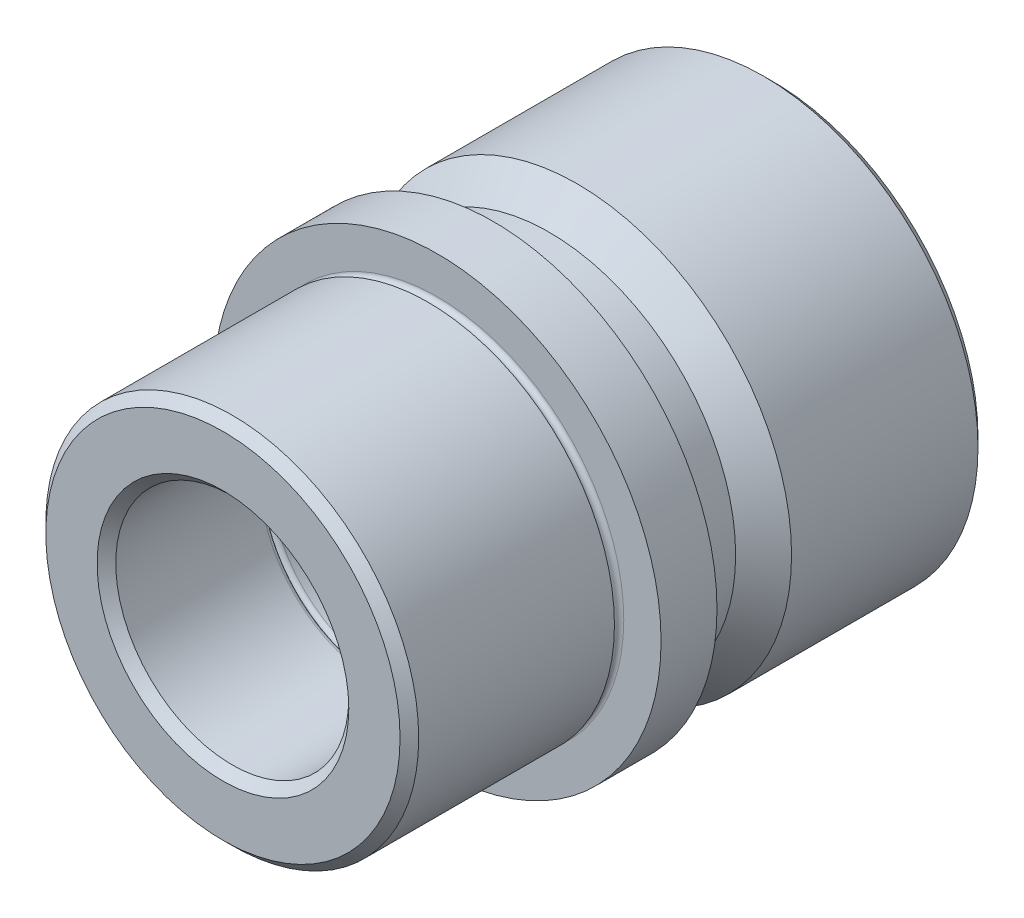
ISO-10303-21;
HEADER;
FILE_DESCRIPTION(('STEP AP214'),'2;1');
FILE_NAME('part.step','',(''),(''),'','','');
FILE_SCHEMA(('AUTOMOTIVE_DESIGN { 1 0 10303 214 1 1 1 1 }'));
ENDSEC;
DATA;
#1=APPLICATION_CONTEXT('core data for automotive mechanical design processes');
#2=APPLICATION_PROTOCOL_DEFINITION('international standard','automotive_design',2000,#1);
#3=PRODUCT_CONTEXT('',#1,'mechanical');
#4=PRODUCT('Part','Part','',(#3));
#5=PRODUCT_RELATED_PRODUCT_CATEGORY('part','',(#4));
#6=PRODUCT_DEFINITION_FORMATION('','',#4);
#7=PRODUCT_DEFINITION_CONTEXT('part definition',#1,'design');
#8=PRODUCT_DEFINITION('design','',#6,#7);
#9=PRODUCT_DEFINITION_SHAPE('','',#8);
#10=(LENGTH_UNIT() NAMED_UNIT(*) SI_UNIT(.MILLI.,.METRE.));
#11=(NAMED_UNIT(*) PLANE_ANGLE_UNIT() SI_UNIT($,.RADIAN.));
#12=(NAMED_UNIT(*) SI_UNIT($,.STERADIAN.) SOLID_ANGLE_UNIT());
#13=UNCERTAINTY_MEASURE_WITH_UNIT(LENGTH_MEASURE(1.E-05),#10,'distance_accuracy_value','');
#14=(GEOMETRIC_REPRESENTATION_CONTEXT(3) GLOBAL_UNCERTAINTY_ASSIGNED_CONTEXT((#13)) GLOBAL_UNIT_ASSIGNED_CONTEXT((#10,
#11,#12)) REPRESENTATION_CONTEXT('',''));
#15=CARTESIAN_POINT('',(0.,0.,0.));
#16=DIRECTION('',(0.,0.,1.));
#17=DIRECTION('',(1.,0.,0.));
#18=AXIS2_PLACEMENT_3D('',#15,#16,#17);
#19=CARTESIAN_POINT('',(0.,0.,-37.5));
#20=DIRECTION('',(0.,0.,1.));
#21=DIRECTION('',(1.,0.,0.));
#22=AXIS2_PLACEMENT_3D('',#19,#20,#21);
#23=TOROIDAL_SURFACE('',#22,13.,0.5);
#24=CARTESIAN_POINT('',(0.,0.,-37.5));
#25=DIRECTION('',(0.,0.,1.));
#26=DIRECTION('',(1.,0.,0.));
#27=AXIS2_PLACEMENT_3D('',#24,#25,#26);
#28=CIRCLE('',#27,12.5);
#29=CARTESIAN_POINT('',(12.5,0.,-37.5));
#30=VERTEX_POINT('',#29);
#31=EDGE_CURVE('E81',#30,#30,#28,.T.);
#32=ORIENTED_EDGE('',*,*,#31,.T.);
#33=EDGE_LOOP('',(#32));
#34=FACE_BOUND('',#33,.T.);
#35=CARTESIAN_POINT('',(0.,0.,-38.));
#36=DIRECTION('',(0.,0.,1.));
#37=DIRECTION('',(1.,0.,0.));
#38=AXIS2_PLACEMENT_3D('',#35,#36,#37);
#39=CIRCLE('',#38,13.);
#40=CARTESIAN_POINT('',(13.,0.,-38.));
#41=VERTEX_POINT('',#40);
#42=EDGE_CURVE('E45',#41,#41,#39,.T.);
#43=ORIENTED_EDGE('',*,*,#42,.F.);
#44=EDGE_LOOP('',(#43));
#45=FACE_BOUND('',#44,.T.);
#46=ADVANCED_FACE('F13',(#34,#45),#23,.T.);
#47=CARTESIAN_POINT('',(0.,0.,-38.5));
#48=DIRECTION('',(0.,0.,1.));
#49=DIRECTION('',(1.,0.,0.));
#50=AXIS2_PLACEMENT_3D('',#47,#48,#49);
#51=TOROIDAL_SURFACE('',#50,13.,0.5);
#52=CARTESIAN_POINT('',(0.,0.,-38.5));
#53=DIRECTION('',(0.,0.,1.));
#54=DIRECTION('',(1.,0.,0.));
#55=AXIS2_PLACEMENT_3D('',#52,#53,#54);
#56=CIRCLE('',#55,12.5);
#57=CARTESIAN_POINT('',(12.5,0.,-38.5));
#58=VERTEX_POINT('',#57);
#59=EDGE_CURVE('E48',#58,#58,#56,.T.);
#60=ORIENTED_EDGE('',*,*,#59,.F.);
#61=EDGE_LOOP('',(#60));
#62=FACE_BOUND('',#61,.T.);
#63=ORIENTED_EDGE('',*,*,#42,.T.);
#64=EDGE_LOOP('',(#63));
#65=FACE_BOUND('',#64,.T.);
#66=ADVANCED_FACE('F114',(#62,#65),#51,.T.);
#67=CARTESIAN_POINT('',(0.,0.,0.));
#68=DIRECTION('',(0.,0.,1.));
#69=DIRECTION('',(1.,0.,0.));
#70=AXIS2_PLACEMENT_3D('',#67,#68,#69);
#71=CYLINDRICAL_SURFACE('',#70,12.5);
#72=CARTESIAN_POINT('',(0.,0.,-58.));
#73=DIRECTION('',(0.,0.,1.));
#74=DIRECTION('',(1.,0.,0.));
#75=AXIS2_PLACEMENT_3D('',#72,#73,#74);
#76=CIRCLE('',#75,12.5);
#77=CARTESIAN_POINT('',(12.5,0.,-58.));
#78=VERTEX_POINT('',#77);
#79=EDGE_CURVE('E36',#78,#78,#76,.F.);
#80=ORIENTED_EDGE('',*,*,#79,.T.);
#81=EDGE_LOOP('',(#80));
#82=FACE_BOUND('',#81,.T.);
#83=ORIENTED_EDGE('',*,*,#59,.T.);
#84=EDGE_LOOP('',(#83));
#85=FACE_BOUND('',#84,.T.);
#86=ADVANCED_FACE('F120',(#82,#85),#71,.F.);
#87=CARTESIAN_POINT('',(0.,0.,-59.));
#88=DIRECTION('',(0.,0.,1.));
#89=DIRECTION('',(1.,0.,0.));
#90=AXIS2_PLACEMENT_3D('',#87,#88,#89);
#91=PLANE('',#90);
#92=CARTESIAN_POINT('',(0.,0.,-59.));
#93=DIRECTION('',(0.,0.,1.));
#94=DIRECTION('',(1.,0.,0.));
#95=AXIS2_PLACEMENT_3D('',#92,#93,#94);
#96=CIRCLE('',#95,13.5);
#97=CARTESIAN_POINT('',(13.5,0.,-59.));
#98=VERTEX_POINT('',#97);
#99=EDGE_CURVE('E39',#98,#98,#96,.T.);
#100=ORIENTED_EDGE('',*,*,#99,.T.);
#101=EDGE_LOOP('',(#100));
#102=FACE_BOUND('',#101,.T.);
#103=CARTESIAN_POINT('',(0.,0.,-59.));
#104=DIRECTION('',(0.,0.,1.));
#105=DIRECTION('',(1.,0.,0.));
#106=AXIS2_PLACEMENT_3D('',#103,#104,#105);
#107=CIRCLE('',#106,22.);
#108=CARTESIAN_POINT('',(22.,0.,-59.));
#109=VERTEX_POINT('',#108);
#110=EDGE_CURVE('E42',#109,#109,#107,.F.);
#111=ORIENTED_EDGE('',*,*,#110,.T.);
#112=EDGE_LOOP('',(#111));
#113=FACE_BOUND('',#112,.T.);
#114=ADVANCED_FACE('F185',(#102,#113),#91,.F.);
#115=CARTESIAN_POINT('',(0.,0.,0.));
#116=DIRECTION('',(0.,0.,1.));
#117=DIRECTION('',(1.,0.,0.));
#118=AXIS2_PLACEMENT_3D('',#115,#116,#117);
#119=CYLINDRICAL_SURFACE('',#118,23.);
#120=CARTESIAN_POINT('',(0.,0.,-58.));
#121=DIRECTION('',(0.,0.,1.));
#122=DIRECTION('',(1.,0.,0.));
#123=AXIS2_PLACEMENT_3D('',#120,#121,#122);
#124=CIRCLE('',#123,23.);
#125=CARTESIAN_POINT('',(23.,0.,-58.));
#126=VERTEX_POINT('',#125);
#127=EDGE_CURVE('E33',#126,#126,#124,.T.);
#128=ORIENTED_EDGE('',*,*,#127,.T.);
#129=EDGE_LOOP('',(#128));
#130=FACE_BOUND('',#129,.T.);
#131=CARTESIAN_POINT('',(0.,0.,-38.));
#132=DIRECTION('',(0.,0.,1.));
#133=DIRECTION('',(1.,0.,0.));
#134=AXIS2_PLACEMENT_3D('',#131,#132,#133);
#135=CIRCLE('',#134,23.);
#136=CARTESIAN_POINT('',(23.,0.,-38.));
#137=VERTEX_POINT('',#136);
#138=EDGE_CURVE('E51',#137,#137,#135,.T.);
#139=ORIENTED_EDGE('',*,*,#138,.F.);
#140=EDGE_LOOP('',(#139));
#141=FACE_BOUND('',#140,.T.);
#142=ADVANCED_FACE('F181',(#130,#141),#119,.T.);
#143=CARTESIAN_POINT('',(0.,0.,-35.));
#144=DIRECTION('',(0.,0.,-1.));
#145=DIRECTION('',(-1.,0.,0.));
#146=AXIS2_PLACEMENT_3D('',#143,#144,#145);
#147=CONICAL_SURFACE('',#146,20.,0.785398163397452);
#148=ORIENTED_EDGE('',*,*,#138,.T.);
#149=EDGE_LOOP('',(#148));
#150=FACE_BOUND('',#149,.T.);
#151=CARTESIAN_POINT('',(0.,0.,-35.));
#152=DIRECTION('',(0.,0.,1.));
#153=DIRECTION('',(1.,0.,0.));
#154=AXIS2_PLACEMENT_3D('',#151,#152,#153);
#155=CIRCLE('',#154,20.);
#156=CARTESIAN_POINT('',(20.,0.,-35.));
#157=VERTEX_POINT('',#156);
#158=EDGE_CURVE('E54',#157,#157,#155,.T.);
#159=ORIENTED_EDGE('',*,*,#158,.F.);
#160=EDGE_LOOP('',(#159));
#161=FACE_BOUND('',#160,.T.);
#162=ADVANCED_FACE('F177',(#150,#161),#147,.T.);
#163=CARTESIAN_POINT('',(0.,0.,0.));
#164=DIRECTION('',(0.,0.,1.));
#165=DIRECTION('',(1.,0.,0.));
#166=AXIS2_PLACEMENT_3D('',#163,#164,#165);
#167=CYLINDRICAL_SURFACE('',#166,20.);
#168=ORIENTED_EDGE('',*,*,#158,.T.);
#169=EDGE_LOOP('',(#168));
#170=FACE_BOUND('',#169,.T.);
#171=CARTESIAN_POINT('',(0.,0.,-29.));
#172=DIRECTION('',(0.,0.,1.));
#173=DIRECTION('',(1.,0.,0.));
#174=AXIS2_PLACEMENT_3D('',#171,#172,#173);
#175=CIRCLE('',#174,20.);
#176=CARTESIAN_POINT('',(20.,0.,-29.));
#177=VERTEX_POINT('',#176);
#178=EDGE_CURVE('E57',#177,#177,#175,.T.);
#179=ORIENTED_EDGE('',*,*,#178,.F.);
#180=EDGE_LOOP('',(#179));
#181=FACE_BOUND('',#180,.T.);
#182=ADVANCED_FACE('F173',(#170,#181),#167,.T.);
#183=CARTESIAN_POINT('',(0.,0.,-29.));
#184=DIRECTION('',(0.,0.,-1.));
#185=DIRECTION('',(-1.,0.,0.));
#186=AXIS2_PLACEMENT_3D('',#183,#184,#185);
#187=PLANE('',#186);
#188=ORIENTED_EDGE('',*,*,#178,.T.);
#189=EDGE_LOOP('',(#188));
#190=FACE_BOUND('',#189,.T.);
#191=CARTESIAN_POINT('',(0.,0.,-29.));
#192=DIRECTION('',(0.,0.,1.));
#193=DIRECTION('',(1.,0.,0.));
#194=AXIS2_PLACEMENT_3D('',#191,#192,#193);
#195=CIRCLE('',#194,24.);
#196=CARTESIAN_POINT('',(24.,0.,-29.));
#197=VERTEX_POINT('',#196);
#198=EDGE_CURVE('E60',#197,#197,#195,.T.);
#199=ORIENTED_EDGE('',*,*,#198,.F.);
#200=EDGE_LOOP('',(#199));
#201=FACE_BOUND('',#200,.T.);
#202=ADVANCED_FACE('F169',(#190,#201),#187,.T.);
#203=CARTESIAN_POINT('',(0.,0.,0.));
#204=DIRECTION('',(0.,0.,1.));
#205=DIRECTION('',(1.,0.,0.));
#206=AXIS2_PLACEMENT_3D('',#203,#204,#205);
#207=CYLINDRICAL_SURFACE('',#206,24.);
#208=ORIENTED_EDGE('',*,*,#198,.T.);
#209=EDGE_LOOP('',(#208));
#210=FACE_BOUND('',#209,.T.);
#211=CARTESIAN_POINT('',(0.,0.,-23.));
#212=DIRECTION('',(0.,0.,1.));
#213=DIRECTION('',(1.,0.,0.));
#214=AXIS2_PLACEMENT_3D('',#211,#212,#213);
#215=CIRCLE('',#214,24.);
#216=CARTESIAN_POINT('',(24.,0.,-23.));
#217=VERTEX_POINT('',#216);
#218=EDGE_CURVE('E63',#217,#217,#215,.T.);
#219=ORIENTED_EDGE('',*,*,#218,.F.);
#220=EDGE_LOOP('',(#219));
#221=FACE_BOUND('',#220,.T.);
#222=ADVANCED_FACE('F165',(#210,#221),#207,.T.);
#223=CARTESIAN_POINT('',(0.,0.,-23.));
#224=DIRECTION('',(0.,0.,1.));
#225=DIRECTION('',(1.,0.,0.));
#226=AXIS2_PLACEMENT_3D('',#223,#224,#225);
#227=PLANE('',#226);
#228=ORIENTED_EDGE('',*,*,#218,.T.);
#229=EDGE_LOOP('',(#228));
#230=FACE_BOUND('',#229,.T.);
#231=CARTESIAN_POINT('',(0.,0.,-23.));
#232=DIRECTION('',(0.,0.,1.));
#233=DIRECTION('',(1.,0.,0.));
#234=AXIS2_PLACEMENT_3D('',#231,#232,#233);
#235=CIRCLE('',#234,20.);
#236=CARTESIAN_POINT('',(20.,0.,-23.));
#237=VERTEX_POINT('',#236);
#238=EDGE_CURVE('E66',#237,#237,#235,.T.);
#239=ORIENTED_EDGE('',*,*,#238,.F.);
#240=EDGE_LOOP('',(#239));
#241=FACE_BOUND('',#240,.T.);
#242=ADVANCED_FACE('F161',(#230,#241),#227,.T.);
#243=CARTESIAN_POINT('',(0.,0.,-22.5));
#244=DIRECTION('',(0.,0.,1.));
#245=DIRECTION('',(1.,0.,0.));
#246=AXIS2_PLACEMENT_3D('',#243,#244,#245);
#247=TOROIDAL_SURFACE('',#246,20.,0.5);
#248=ORIENTED_EDGE('',*,*,#238,.T.);
#249=EDGE_LOOP('',(#248));
#250=FACE_BOUND('',#249,.T.);
#251=CARTESIAN_POINT('',(0.,0.,-22.));
#252=DIRECTION('',(0.,0.,1.));
#253=DIRECTION('',(1.,0.,0.));
#254=AXIS2_PLACEMENT_3D('',#251,#252,#253);
#255=CIRCLE('',#254,20.);
#256=CARTESIAN_POINT('',(20.,0.,-22.));
#257=VERTEX_POINT('',#256);
#258=EDGE_CURVE('E69',#257,#257,#255,.T.);
#259=ORIENTED_EDGE('',*,*,#258,.F.);
#260=EDGE_LOOP('',(#259));
#261=FACE_BOUND('',#260,.T.);
#262=ADVANCED_FACE('F156',(#250,#261),#247,.F.);
#263=CARTESIAN_POINT('',(0.,0.,0.));
#264=DIRECTION('',(0.,0.,1.));
#265=DIRECTION('',(1.,0.,0.));
#266=AXIS2_PLACEMENT_3D('',#263,#264,#265);
#267=CYLINDRICAL_SURFACE('',#266,20.);
#268=CARTESIAN_POINT('',(0.,0.,-1.));
#269=DIRECTION('',(0.,0.,1.));
#270=DIRECTION('',(1.,0.,0.));
#271=AXIS2_PLACEMENT_3D('',#268,#269,#270);
#272=CIRCLE('',#271,20.);
#273=CARTESIAN_POINT('',(20.,0.,-1.));
#274=VERTEX_POINT('',#273);
#275=EDGE_CURVE('E8',#274,#274,#272,.F.);
#276=ORIENTED_EDGE('',*,*,#275,.T.);
#277=EDGE_LOOP('',(#276));
#278=FACE_BOUND('',#277,.T.);
#279=ORIENTED_EDGE('',*,*,#258,.T.);
#280=EDGE_LOOP('',(#279));
#281=FACE_BOUND('',#280,.T.);
#282=ADVANCED_FACE('F150',(#278,#281),#267,.T.);
#283=CARTESIAN_POINT('',(0.,0.,0.));
#284=DIRECTION('',(0.,0.,1.));
#285=DIRECTION('',(1.,0.,0.));
#286=AXIS2_PLACEMENT_3D('',#283,#284,#285);
#287=PLANE('',#286);
#288=CARTESIAN_POINT('',(0.,0.,0.));
#289=DIRECTION('',(0.,0.,1.));
#290=DIRECTION('',(1.,0.,0.));
#291=AXIS2_PLACEMENT_3D('',#288,#289,#290);
#292=CIRCLE('',#291,13.5);
#293=CARTESIAN_POINT('',(13.5,0.,0.));
#294=VERTEX_POINT('',#293);
#295=EDGE_CURVE('E20',#294,#294,#292,.F.);
#296=ORIENTED_EDGE('',*,*,#295,.T.);
#297=EDGE_LOOP('',(#296));
#298=FACE_BOUND('',#297,.T.);
#299=CARTESIAN_POINT('',(0.,0.,0.));
#300=DIRECTION('',(0.,0.,1.));
#301=DIRECTION('',(1.,0.,0.));
#302=AXIS2_PLACEMENT_3D('',#299,#300,#301);
#303=CIRCLE('',#302,19.);
#304=CARTESIAN_POINT('',(19.,0.,0.));
#305=VERTEX_POINT('',#304);
#306=EDGE_CURVE('E24',#305,#305,#303,.T.);
#307=ORIENTED_EDGE('',*,*,#306,.T.);
#308=EDGE_LOOP('',(#307));
#309=FACE_BOUND('',#308,.T.);
#310=ADVANCED_FACE('F110',(#298,#309),#287,.T.);
#311=CARTESIAN_POINT('',(0.,0.,0.));
#312=DIRECTION('',(0.,0.,1.));
#313=DIRECTION('',(1.,0.,0.));
#314=AXIS2_PLACEMENT_3D('',#311,#312,#313);
#315=CYLINDRICAL_SURFACE('',#314,12.5);
#316=CARTESIAN_POINT('',(0.,0.,-1.));
#317=DIRECTION('',(0.,0.,1.));
#318=DIRECTION('',(1.,0.,0.));
#319=AXIS2_PLACEMENT_3D('',#316,#317,#318);
#320=CIRCLE('',#319,12.5);
#321=CARTESIAN_POINT('',(12.5,0.,-1.));
#322=VERTEX_POINT('',#321);
#323=EDGE_CURVE('E28',#322,#322,#320,.T.);
#324=ORIENTED_EDGE('',*,*,#323,.T.);
#325=EDGE_LOOP('',(#324));
#326=FACE_BOUND('',#325,.T.);
#327=CARTESIAN_POINT('',(0.,0.,-16.5));
#328=DIRECTION('',(0.,0.,1.));
#329=DIRECTION('',(1.,0.,0.));
#330=AXIS2_PLACEMENT_3D('',#327,#328,#329);
#331=CIRCLE('',#330,12.5);
#332=CARTESIAN_POINT('',(12.5,0.,-16.5));
#333=VERTEX_POINT('',#332);
#334=EDGE_CURVE('E72',#333,#333,#331,.T.);
#335=ORIENTED_EDGE('',*,*,#334,.F.);
#336=EDGE_LOOP('',(#335));
#337=FACE_BOUND('',#336,.T.);
#338=ADVANCED_FACE('F102',(#326,#337),#315,.F.);
#339=CARTESIAN_POINT('',(0.,0.,-16.5));
#340=DIRECTION('',(0.,0.,1.));
#341=DIRECTION('',(1.,0.,0.));
#342=AXIS2_PLACEMENT_3D('',#339,#340,#341);
#343=TOROIDAL_SURFACE('',#342,13.,0.5);
#344=ORIENTED_EDGE('',*,*,#334,.T.);
#345=EDGE_LOOP('',(#344));
#346=FACE_BOUND('',#345,.T.);
#347=CARTESIAN_POINT('',(0.,0.,-17.));
#348=DIRECTION('',(0.,0.,1.));
#349=DIRECTION('',(1.,0.,0.));
#350=AXIS2_PLACEMENT_3D('',#347,#348,#349);
#351=CIRCLE('',#350,13.);
#352=CARTESIAN_POINT('',(13.,0.,-17.));
#353=VERTEX_POINT('',#352);
#354=EDGE_CURVE('E75',#353,#353,#351,.T.);
#355=ORIENTED_EDGE('',*,*,#354,.F.);
#356=EDGE_LOOP('',(#355));
#357=FACE_BOUND('',#356,.T.);
#358=ADVANCED_FACE('F97',(#346,#357),#343,.T.);
#359=CARTESIAN_POINT('',(0.,0.,-17.5));
#360=DIRECTION('',(0.,0.,1.));
#361=DIRECTION('',(1.,0.,0.));
#362=AXIS2_PLACEMENT_3D('',#359,#360,#361);
#363=TOROIDAL_SURFACE('',#362,13.,0.5);
#364=CARTESIAN_POINT('',(0.,0.,-17.5));
#365=DIRECTION('',(0.,0.,1.));
#366=DIRECTION('',(1.,0.,0.));
#367=AXIS2_PLACEMENT_3D('',#364,#365,#366);
#368=CIRCLE('',#367,12.5);
#369=CARTESIAN_POINT('',(12.5,0.,-17.5));
#370=VERTEX_POINT('',#369);
#371=EDGE_CURVE('E78',#370,#370,#368,.T.);
#372=ORIENTED_EDGE('',*,*,#371,.F.);
#373=EDGE_LOOP('',(#372));
#374=FACE_BOUND('',#373,.T.);
#375=ORIENTED_EDGE('',*,*,#354,.T.);
#376=EDGE_LOOP('',(#375));
#377=FACE_BOUND('',#376,.T.);
#378=ADVANCED_FACE('F91',(#374,#377),#363,.T.);
#379=CARTESIAN_POINT('',(0.,0.,0.));
#380=DIRECTION('',(0.,0.,1.));
#381=DIRECTION('',(1.,0.,0.));
#382=AXIS2_PLACEMENT_3D('',#379,#380,#381);
#383=CYLINDRICAL_SURFACE('',#382,12.5);
#384=ORIENTED_EDGE('',*,*,#31,.F.);
#385=EDGE_LOOP('',(#384));
#386=FACE_BOUND('',#385,.T.);
#387=ORIENTED_EDGE('',*,*,#371,.T.);
#388=EDGE_LOOP('',(#387));
#389=FACE_BOUND('',#388,.T.);
#390=ADVANCED_FACE('F87',(#386,#389),#383,.F.);
#391=CARTESIAN_POINT('',(0.,0.,-59.));
#392=DIRECTION('',(0.,0.,-1.));
#393=DIRECTION('',(-1.,0.,0.));
#394=AXIS2_PLACEMENT_3D('',#391,#392,#393);
#395=CONICAL_SURFACE('',#394,13.5,0.78539816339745);
#396=ORIENTED_EDGE('',*,*,#79,.F.);
#397=EDGE_LOOP('',(#396));
#398=FACE_BOUND('',#397,.T.);
#399=ORIENTED_EDGE('',*,*,#99,.F.);
#400=EDGE_LOOP('',(#399));
#401=FACE_BOUND('',#400,.T.);
#402=ADVANCED_FACE('F90',(#398,#401),#395,.F.);
#403=CARTESIAN_POINT('',(0.,0.,-58.));
#404=DIRECTION('',(0.,0.,1.));
#405=DIRECTION('',(1.,0.,0.));
#406=AXIS2_PLACEMENT_3D('',#403,#404,#405);
#407=CONICAL_SURFACE('',#406,23.,0.785398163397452);
#408=ORIENTED_EDGE('',*,*,#110,.F.);
#409=EDGE_LOOP('',(#408));
#410=FACE_BOUND('',#409,.T.);
#411=ORIENTED_EDGE('',*,*,#127,.F.);
#412=EDGE_LOOP('',(#411));
#413=FACE_BOUND('',#412,.T.);
#414=ADVANCED_FACE('F127',(#410,#413),#407,.T.);
#415=CARTESIAN_POINT('',(0.,0.,-1.));
#416=DIRECTION('',(0.,0.,1.));
#417=DIRECTION('',(1.,0.,0.));
#418=AXIS2_PLACEMENT_3D('',#415,#416,#417);
#419=CONICAL_SURFACE('',#418,12.5,0.785398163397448);
#420=ORIENTED_EDGE('',*,*,#295,.F.);
#421=EDGE_LOOP('',(#420));
#422=FACE_BOUND('',#421,.T.);
#423=ORIENTED_EDGE('',*,*,#323,.F.);
#424=EDGE_LOOP('',(#423));
#425=FACE_BOUND('',#424,.T.);
#426=ADVANCED_FACE('F130',(#422,#425),#419,.F.);
#427=CARTESIAN_POINT('',(0.,0.,0.));
#428=DIRECTION('',(0.,0.,-1.));
#429=DIRECTION('',(-1.,0.,0.));
#430=AXIS2_PLACEMENT_3D('',#427,#428,#429);
#431=CONICAL_SURFACE('',#430,19.,0.785398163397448);
#432=ORIENTED_EDGE('',*,*,#275,.F.);
#433=EDGE_LOOP('',(#432));
#434=FACE_BOUND('',#433,.T.);
#435=ORIENTED_EDGE('',*,*,#306,.F.);
#436=EDGE_LOOP('',(#435));
#437=FACE_BOUND('',#436,.T.);
#438=ADVANCED_FACE('F15',(#434,#437),#431,.T.);
#439=CLOSED_SHELL('',(#46,#66,#86,#114,#142,#162,#182,#202,#222,#242,#262,#282,#310,#338,#358,
#378,#390,#402,#414,#426,#438));
#440=MANIFOLD_SOLID_BREP('B1',#439);
#441=ADVANCED_BREP_SHAPE_REPRESENTATION('',(#18,#440),#14);
#442=SHAPE_DEFINITION_REPRESENTATION(#9,#441);
ENDSEC;
END-ISO-10303-21;
